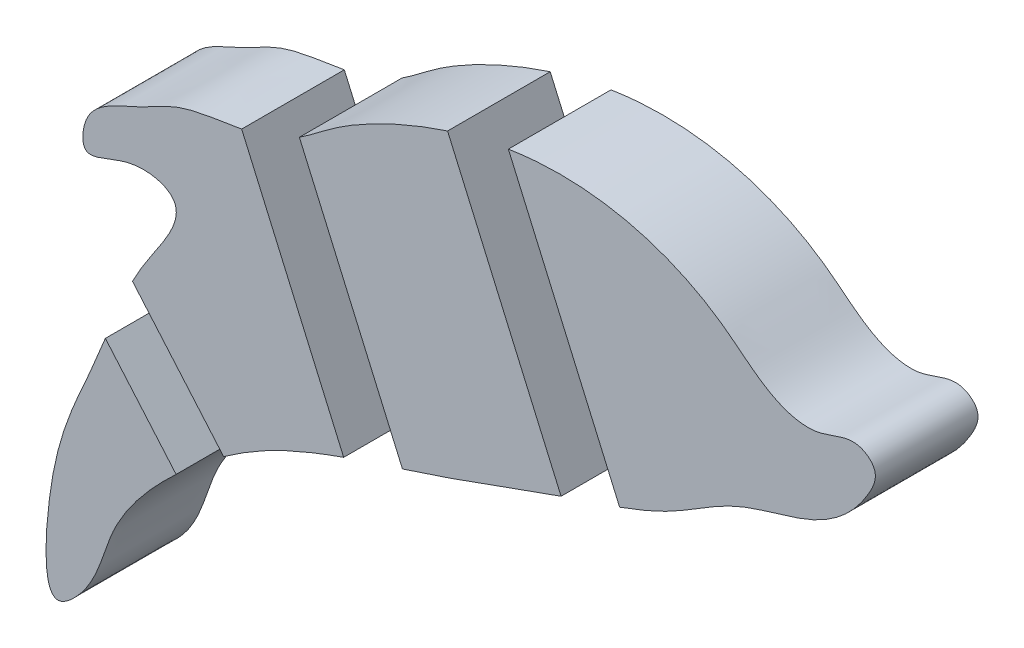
ISO-10303-21;
HEADER;
FILE_DESCRIPTION(('STEP AP214'),'2;1');
FILE_NAME('part.step','',(''),(''),'','','');
FILE_SCHEMA(('AUTOMOTIVE_DESIGN { 1 0 10303 214 1 1 1 1 }'));
ENDSEC;
DATA;
#1=APPLICATION_CONTEXT('core data for automotive mechanical design processes');
#2=APPLICATION_PROTOCOL_DEFINITION('international standard','automotive_design',2000,#1);
#3=PRODUCT_CONTEXT('',#1,'mechanical');
#4=PRODUCT('Part','Part','',(#3));
#5=PRODUCT_RELATED_PRODUCT_CATEGORY('part','',(#4));
#6=PRODUCT_DEFINITION_FORMATION('','',#4);
#7=PRODUCT_DEFINITION_CONTEXT('part definition',#1,'design');
#8=PRODUCT_DEFINITION('design','',#6,#7);
#9=PRODUCT_DEFINITION_SHAPE('','',#8);
#10=(LENGTH_UNIT() NAMED_UNIT(*) SI_UNIT(.MILLI.,.METRE.));
#11=(NAMED_UNIT(*) PLANE_ANGLE_UNIT() SI_UNIT($,.RADIAN.));
#12=(NAMED_UNIT(*) SI_UNIT($,.STERADIAN.) SOLID_ANGLE_UNIT());
#13=UNCERTAINTY_MEASURE_WITH_UNIT(LENGTH_MEASURE(1.E-05),#10,'distance_accuracy_value','');
#14=(GEOMETRIC_REPRESENTATION_CONTEXT(3) GLOBAL_UNCERTAINTY_ASSIGNED_CONTEXT((#13)) GLOBAL_UNIT_ASSIGNED_CONTEXT((#10,
#11,#12)) REPRESENTATION_CONTEXT('',''));
#15=CARTESIAN_POINT('',(0.,0.,0.));
#16=DIRECTION('',(0.,0.,1.));
#17=DIRECTION('',(1.,0.,0.));
#18=AXIS2_PLACEMENT_3D('',#15,#16,#17);
#19=CARTESIAN_POINT('',(37.1203059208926,62.2396272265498,-5.));
#20=CARTESIAN_POINT('',(35.8660979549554,61.6381032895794,-5.));
#21=CARTESIAN_POINT('',(32.30863685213,60.7225927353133,-5.));
#22=CARTESIAN_POINT('',(27.2047300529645,60.3353029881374,-5.));
#23=CARTESIAN_POINT('',(22.39359329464,57.2751362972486,-5.));
#24=CARTESIAN_POINT('',(17.6999358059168,55.9443120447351,-5.));
#25=CARTESIAN_POINT('',(17.4314041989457,50.3712261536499,-5.));
#26=CARTESIAN_POINT('',(22.1255242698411,53.5459282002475,-5.));
#27=CARTESIAN_POINT('',(28.8152586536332,51.946359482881,-5.));
#28=CARTESIAN_POINT('',(23.1875203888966,44.8884076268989,-5.));
#29=CARTESIAN_POINT('',(20.9504485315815,39.7039102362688,-5.));
#30=CARTESIAN_POINT('',(17.4594819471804,30.7189621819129,-5.));
#31=CARTESIAN_POINT('',(14.1286485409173,25.0744795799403,-5.));
#32=CARTESIAN_POINT('',(13.6862287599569,10.3506758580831,-5.));
#33=CARTESIAN_POINT('',(19.0000210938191,15.3545316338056,-5.));
#34=CARTESIAN_POINT('',(20.0722932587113,21.6561097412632,-5.));
#35=CARTESIAN_POINT('',(26.5069997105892,29.0202375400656,-5.));
#36=CARTESIAN_POINT('',(36.7158844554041,36.763379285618,-5.));
#37=CARTESIAN_POINT('',(50.750427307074,40.5000919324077,-5.));
#38=CARTESIAN_POINT('',(63.859053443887,45.672520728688,-5.));
#39=CARTESIAN_POINT('',(74.2681220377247,48.7767213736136,-5.));
#40=CARTESIAN_POINT('',(81.3393233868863,54.0116663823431,-5.));
#41=CARTESIAN_POINT('',(89.0836168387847,55.2702221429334,-5.));
#42=CARTESIAN_POINT('',(93.4566346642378,59.091979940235,-5.));
#43=CARTESIAN_POINT('',(95.278660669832,63.0436417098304,-5.));
#44=CARTESIAN_POINT('',(92.6379427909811,65.1390069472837,-5.));
#45=CARTESIAN_POINT('',(89.3712942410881,62.9217343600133,-5.));
#46=CARTESIAN_POINT('',(84.378691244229,64.0632459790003,-5.));
#47=CARTESIAN_POINT('',(79.79312847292,68.4909604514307,-5.));
#48=CARTESIAN_POINT('',(72.1298778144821,72.2088629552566,-5.));
#49=CARTESIAN_POINT('',(63.3104934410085,73.128814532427,-5.));
#50=CARTESIAN_POINT('',(54.9234616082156,71.6633869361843,-5.));
#51=CARTESIAN_POINT('',(48.0872509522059,69.1247057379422,-5.));
#52=CARTESIAN_POINT('',(42.0706842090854,65.8735932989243,-5.));
#53=CARTESIAN_POINT('',(38.8595370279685,63.0737705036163,-5.));
#54=CARTESIAN_POINT('',(37.1203059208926,62.2396272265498,-5.));
#55=B_SPLINE_CURVE_WITH_KNOTS('',3,(#19,#20,#21,#22,#23,#24,#25,#26,#27,#28,#29,#30,#31,#32,#33,
#34,#35,#36,#37,#38,#39,#40,#41,#42,#43,#44,#45,#46,#47,#48,#49,#50,#51,#52,#53,#54),
.UNSPECIFIED.,.T.,.F.,(4,1,1,1,1,1,1,1,1,1,1,1,1,1,1,1,1,1,1,1,1,1,1,1,1,1,1,1,1,1,1,1,1,4),(0.,
0.0179608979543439,0.0463689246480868,0.0634560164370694,0.0916658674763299,0.100002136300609,
0.118054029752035,0.137946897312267,0.167684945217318,0.196422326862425,0.220416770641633,
0.283698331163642,0.315678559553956,0.327019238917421,0.357634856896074,0.400499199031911,
0.44544644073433,0.521184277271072,0.582377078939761,0.626691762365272,0.658573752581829,
0.693177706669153,0.722667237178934,0.733029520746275,0.740414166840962,0.758218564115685,
0.775563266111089,0.801847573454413,0.838498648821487,0.882370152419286,0.912708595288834,
0.946724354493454,0.975093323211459,1.),.UNSPECIFIED.);
#56=DIRECTION('',(0.,0.,1.));
#57=VECTOR('',#56,1.);
#58=SURFACE_OF_LINEAR_EXTRUSION('',#55,#57);
#59=CARTESIAN_POINT('',(37.1203059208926,62.2396272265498,5.));
#60=CARTESIAN_POINT('',(35.8660979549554,61.6381032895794,5.));
#61=CARTESIAN_POINT('',(32.30863685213,60.7225927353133,5.));
#62=CARTESIAN_POINT('',(27.2047300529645,60.3353029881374,5.));
#63=CARTESIAN_POINT('',(22.39359329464,57.2751362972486,5.));
#64=CARTESIAN_POINT('',(17.6999358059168,55.9443120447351,5.));
#65=CARTESIAN_POINT('',(17.4314041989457,50.3712261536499,5.));
#66=CARTESIAN_POINT('',(22.1255242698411,53.5459282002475,5.));
#67=CARTESIAN_POINT('',(28.8152586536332,51.946359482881,5.));
#68=CARTESIAN_POINT('',(23.1875203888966,44.8884076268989,5.));
#69=CARTESIAN_POINT('',(20.9504485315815,39.7039102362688,5.));
#70=CARTESIAN_POINT('',(17.4594819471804,30.7189621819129,5.));
#71=CARTESIAN_POINT('',(14.1286485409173,25.0744795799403,5.));
#72=CARTESIAN_POINT('',(13.6862287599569,10.3506758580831,5.));
#73=CARTESIAN_POINT('',(19.0000210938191,15.3545316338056,5.));
#74=CARTESIAN_POINT('',(20.0722932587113,21.6561097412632,5.));
#75=CARTESIAN_POINT('',(26.5069997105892,29.0202375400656,5.));
#76=CARTESIAN_POINT('',(36.7158844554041,36.763379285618,5.));
#77=CARTESIAN_POINT('',(50.750427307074,40.5000919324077,5.));
#78=CARTESIAN_POINT('',(63.859053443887,45.672520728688,5.));
#79=CARTESIAN_POINT('',(74.2681220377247,48.7767213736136,5.));
#80=CARTESIAN_POINT('',(81.3393233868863,54.0116663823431,5.));
#81=CARTESIAN_POINT('',(89.0836168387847,55.2702221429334,5.));
#82=CARTESIAN_POINT('',(93.4566346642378,59.091979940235,5.));
#83=CARTESIAN_POINT('',(95.278660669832,63.0436417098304,5.));
#84=CARTESIAN_POINT('',(92.6379427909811,65.1390069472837,5.));
#85=CARTESIAN_POINT('',(89.3712942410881,62.9217343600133,5.));
#86=CARTESIAN_POINT('',(84.378691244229,64.0632459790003,5.));
#87=CARTESIAN_POINT('',(79.79312847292,68.4909604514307,5.));
#88=CARTESIAN_POINT('',(72.1298778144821,72.2088629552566,5.));
#89=CARTESIAN_POINT('',(63.3104934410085,73.128814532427,5.));
#90=CARTESIAN_POINT('',(54.9234616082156,71.6633869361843,5.));
#91=CARTESIAN_POINT('',(48.0872509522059,69.1247057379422,5.));
#92=CARTESIAN_POINT('',(42.0706842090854,65.8735932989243,5.));
#93=CARTESIAN_POINT('',(38.8595370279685,63.0737705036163,5.));
#94=CARTESIAN_POINT('',(37.1203059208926,62.2396272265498,5.));
#95=B_SPLINE_CURVE_WITH_KNOTS('',3,(#59,#60,#61,#62,#63,#64,#65,#66,#67,#68,#69,#70,#71,#72,#73,
#74,#75,#76,#77,#78,#79,#80,#81,#82,#83,#84,#85,#86,#87,#88,#89,#90,#91,#92,#93,#94),
.UNSPECIFIED.,.T.,.F.,(4,1,1,1,1,1,1,1,1,1,1,1,1,1,1,1,1,1,1,1,1,1,1,1,1,1,1,1,1,1,1,1,1,4),(0.,
0.0179608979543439,0.0463689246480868,0.0634560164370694,0.0916658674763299,0.100002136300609,
0.118054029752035,0.137946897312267,0.167684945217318,0.196422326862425,0.220416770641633,
0.283698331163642,0.315678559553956,0.327019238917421,0.357634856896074,0.400499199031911,
0.44544644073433,0.521184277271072,0.582377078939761,0.626691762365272,0.658573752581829,
0.693177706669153,0.722667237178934,0.733029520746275,0.740414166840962,0.758218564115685,
0.775563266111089,0.801847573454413,0.838498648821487,0.882370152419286,0.912708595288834,
0.946724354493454,0.975093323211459,1.),.UNSPECIFIED.);
#96=CARTESIAN_POINT('',(69.8901699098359,47.5297834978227,5.));
#97=VERTEX_POINT('',#96);
#98=CARTESIAN_POINT('',(59.0503238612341,72.3205408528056,5.));
#99=VERTEX_POINT('',#98);
#100=EDGE_CURVE('E55',#97,#99,#95,.T.);
#101=ORIENTED_EDGE('',*,*,#100,.F.);
#102=DIRECTION('',(0.,0.,1.));
#103=VECTOR('',#102,1.);
#104=CARTESIAN_POINT('',(69.8901699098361,47.5297834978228,-5.));
#105=LINE('',#104,#103);
#106=CARTESIAN_POINT('',(69.8901699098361,47.5297834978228,-5.));
#107=VERTEX_POINT('',#106);
#108=EDGE_CURVE('E68',#97,#107,#105,.F.);
#109=ORIENTED_EDGE('',*,*,#108,.T.);
#110=CARTESIAN_POINT('',(59.0503238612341,72.3205408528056,-5.));
#111=VERTEX_POINT('',#110);
#112=EDGE_CURVE('E83',#107,#111,#55,.T.);
#113=ORIENTED_EDGE('',*,*,#112,.T.);
#114=DIRECTION('',(0.,0.,1.));
#115=VECTOR('',#114,1.);
#116=CARTESIAN_POINT('',(59.0503238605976,72.3205408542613,-5.));
#117=LINE('',#116,#115);
#118=EDGE_CURVE('E75',#111,#99,#117,.T.);
#119=ORIENTED_EDGE('',*,*,#118,.T.);
#120=EDGE_LOOP('',(#101,#109,#113,#119));
#121=FACE_BOUND('',#120,.T.);
#122=ADVANCED_FACE('F51',(#121),#58,.T.);
#123=CARTESIAN_POINT('',(46.9083327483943,39.5904772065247,-5.));
#124=DIRECTION('',(0.,0.,-1.));
#125=DIRECTION('',(-1.,0.,0.));
#126=AXIS2_PLACEMENT_3D('',#123,#124,#125);
#127=PLANE('',#126);
#128=ORIENTED_EDGE('',*,*,#112,.F.);
#129=DIRECTION('',(-0.400629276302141,0.916240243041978,0.));
#130=VECTOR('',#129,1.);
#131=CARTESIAN_POINT('',(58.298125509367,74.0408205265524,-5.));
#132=LINE('',#131,#130);
#133=EDGE_CURVE('E78',#107,#111,#132,.T.);
#134=ORIENTED_EDGE('',*,*,#133,.T.);
#135=EDGE_LOOP('',(#128,#134));
#136=FACE_BOUND('',#135,.T.);
#137=ADVANCED_FACE('F87',(#136),#127,.T.);
#138=CARTESIAN_POINT('',(46.9083327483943,39.5904772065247,5.));
#139=DIRECTION('',(0.,0.,-1.));
#140=DIRECTION('',(-1.,0.,0.));
#141=AXIS2_PLACEMENT_3D('',#138,#139,#140);
#142=PLANE('',#141);
#143=DIRECTION('',(-0.400629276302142,0.916240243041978,0.));
#144=VECTOR('',#143,1.);
#145=CARTESIAN_POINT('',(69.115799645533,49.3007703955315,5.));
#146=LINE('',#145,#144);
#147=EDGE_CURVE('E12',#97,#99,#146,.T.);
#148=ORIENTED_EDGE('',*,*,#147,.F.);
#149=ORIENTED_EDGE('',*,*,#100,.T.);
#150=EDGE_LOOP('',(#148,#149));
#151=FACE_BOUND('',#150,.T.);
#152=ADVANCED_FACE('F97',(#151),#142,.F.);
#153=CARTESIAN_POINT('',(58.298125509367,74.0408205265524,5.));
#154=DIRECTION('',(-0.916240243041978,-0.400629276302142,0.));
#155=DIRECTION('',(0.400629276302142,-0.916240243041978,0.));
#156=AXIS2_PLACEMENT_3D('',#153,#154,#155);
#157=PLANE('',#156);
#158=ORIENTED_EDGE('',*,*,#147,.T.);
#159=ORIENTED_EDGE('',*,*,#118,.F.);
#160=ORIENTED_EDGE('',*,*,#133,.F.);
#161=ORIENTED_EDGE('',*,*,#108,.F.);
#162=EDGE_LOOP('',(#158,#159,#160,#161));
#163=FACE_BOUND('',#162,.T.);
#164=ADVANCED_FACE('F77',(#163),#157,.T.);
#165=CLOSED_SHELL('',(#122,#137,#152,#164));
#166=MANIFOLD_SOLID_BREP('B2',#165);
#167=CARTESIAN_POINT('',(46.9083327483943,39.5904772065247,5.));
#168=DIRECTION('',(0.,0.,-1.));
#169=DIRECTION('',(-1.,0.,0.));
#170=AXIS2_PLACEMENT_3D('',#167,#168,#169);
#171=PLANE('',#170);
#172=DIRECTION('',(0.400629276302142,-0.916240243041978,0.));
#173=VECTOR('',#172,1.);
#174=CARTESIAN_POINT('',(43.1566051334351,37.9500210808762,5.));
#175=LINE('',#174,#173);
#176=CARTESIAN_POINT('',(33.0687861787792,61.0208903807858,5.));
#177=VERTEX_POINT('',#176);
#178=CARTESIAN_POINT('',(43.0074433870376,38.2911544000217,5.));
#179=VERTEX_POINT('',#178);
#180=EDGE_CURVE('E49',#177,#179,#175,.T.);
#181=ORIENTED_EDGE('',*,*,#180,.F.);
#182=CARTESIAN_POINT('',(37.1203059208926,62.2396272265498,5.));
#183=CARTESIAN_POINT('',(35.8660979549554,61.6381032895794,5.));
#184=CARTESIAN_POINT('',(32.30863685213,60.7225927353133,5.));
#185=CARTESIAN_POINT('',(27.2047300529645,60.3353029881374,5.));
#186=CARTESIAN_POINT('',(22.39359329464,57.2751362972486,5.));
#187=CARTESIAN_POINT('',(17.6999358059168,55.9443120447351,5.));
#188=CARTESIAN_POINT('',(17.4314041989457,50.3712261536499,5.));
#189=CARTESIAN_POINT('',(22.1255242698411,53.5459282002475,5.));
#190=CARTESIAN_POINT('',(28.8152586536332,51.946359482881,5.));
#191=CARTESIAN_POINT('',(23.1875203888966,44.8884076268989,5.));
#192=CARTESIAN_POINT('',(20.9504485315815,39.7039102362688,5.));
#193=CARTESIAN_POINT('',(17.4594819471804,30.7189621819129,5.));
#194=CARTESIAN_POINT('',(14.1286485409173,25.0744795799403,5.));
#195=CARTESIAN_POINT('',(13.6862287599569,10.3506758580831,5.));
#196=CARTESIAN_POINT('',(19.0000210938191,15.3545316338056,5.));
#197=CARTESIAN_POINT('',(20.0722932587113,21.6561097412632,5.));
#198=CARTESIAN_POINT('',(26.5069997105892,29.0202375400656,5.));
#199=CARTESIAN_POINT('',(36.7158844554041,36.763379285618,5.));
#200=CARTESIAN_POINT('',(50.750427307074,40.5000919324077,5.));
#201=CARTESIAN_POINT('',(63.859053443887,45.672520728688,5.));
#202=CARTESIAN_POINT('',(74.2681220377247,48.7767213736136,5.));
#203=CARTESIAN_POINT('',(81.3393233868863,54.0116663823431,5.));
#204=CARTESIAN_POINT('',(89.0836168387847,55.2702221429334,5.));
#205=CARTESIAN_POINT('',(93.4566346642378,59.091979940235,5.));
#206=CARTESIAN_POINT('',(95.278660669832,63.0436417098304,5.));
#207=CARTESIAN_POINT('',(92.6379427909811,65.1390069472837,5.));
#208=CARTESIAN_POINT('',(89.3712942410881,62.9217343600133,5.));
#209=CARTESIAN_POINT('',(84.378691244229,64.0632459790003,5.));
#210=CARTESIAN_POINT('',(79.79312847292,68.4909604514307,5.));
#211=CARTESIAN_POINT('',(72.1298778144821,72.2088629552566,5.));
#212=CARTESIAN_POINT('',(63.3104934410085,73.128814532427,5.));
#213=CARTESIAN_POINT('',(54.9234616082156,71.6633869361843,5.));
#214=CARTESIAN_POINT('',(48.0872509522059,69.1247057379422,5.));
#215=CARTESIAN_POINT('',(42.0706842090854,65.8735932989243,5.));
#216=CARTESIAN_POINT('',(38.8595370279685,63.0737705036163,5.));
#217=CARTESIAN_POINT('',(37.1203059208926,62.2396272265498,5.));
#218=B_SPLINE_CURVE_WITH_KNOTS('',3,(#182,#183,#184,#185,#186,#187,#188,#189,#190,#191,#192,
#193,#194,#195,#196,#197,#198,#199,#200,#201,#202,#203,#204,#205,#206,#207,#208,#209,#210,#211,
#212,#213,#214,#215,#216,#217),.UNSPECIFIED.,.T.,.F.,(4,1,1,1,1,1,1,1,1,1,1,1,1,1,1,1,1,1,1,1,1,
1,1,1,1,1,1,1,1,1,1,1,1,4),(0.,0.0179608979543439,0.0463689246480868,0.0634560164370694,
0.0916658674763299,0.100002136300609,0.118054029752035,0.137946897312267,0.167684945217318,
0.196422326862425,0.220416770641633,0.283698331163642,0.315678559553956,0.327019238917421,
0.357634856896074,0.400499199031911,0.44544644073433,0.521184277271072,0.582377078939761,
0.626691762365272,0.658573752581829,0.693177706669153,0.722667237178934,0.733029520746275,
0.740414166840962,0.758218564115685,0.775563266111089,0.801847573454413,0.838498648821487,
0.882370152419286,0.912708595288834,0.946724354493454,0.975093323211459,1.),.UNSPECIFIED.);
#219=CARTESIAN_POINT('',(22.4288288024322,42.8628652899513,5.));
#220=VERTEX_POINT('',#219);
#221=EDGE_CURVE('E148',#177,#220,#218,.T.);
#222=ORIENTED_EDGE('',*,*,#221,.T.);
#223=DIRECTION('',(-0.651132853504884,0.758963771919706,0.));
#224=VECTOR('',#223,1.);
#225=CARTESIAN_POINT('',(34.4246710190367,28.8804504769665,5.));
#226=LINE('',#225,#224);
#227=CARTESIAN_POINT('',(31.3137634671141,32.506540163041,5.));
#228=VERTEX_POINT('',#227);
#229=EDGE_CURVE('E155',#228,#220,#226,.T.);
#230=ORIENTED_EDGE('',*,*,#229,.F.);
#231=EDGE_CURVE('E217',#228,#179,#218,.T.);
#232=ORIENTED_EDGE('',*,*,#231,.T.);
#233=EDGE_LOOP('',(#181,#222,#230,#232));
#234=FACE_BOUND('',#233,.T.);
#235=ADVANCED_FACE('F143',(#234),#171,.F.);
#236=CARTESIAN_POINT('',(46.9083327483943,39.5904772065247,-5.));
#237=DIRECTION('',(0.,0.,-1.));
#238=DIRECTION('',(-1.,0.,0.));
#239=AXIS2_PLACEMENT_3D('',#236,#237,#238);
#240=PLANE('',#239);
#241=CARTESIAN_POINT('',(37.1203059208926,62.2396272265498,-5.));
#242=CARTESIAN_POINT('',(35.8660979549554,61.6381032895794,-5.));
#243=CARTESIAN_POINT('',(32.30863685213,60.7225927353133,-5.));
#244=CARTESIAN_POINT('',(27.2047300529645,60.3353029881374,-5.));
#245=CARTESIAN_POINT('',(22.39359329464,57.2751362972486,-5.));
#246=CARTESIAN_POINT('',(17.6999358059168,55.9443120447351,-5.));
#247=CARTESIAN_POINT('',(17.4314041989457,50.3712261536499,-5.));
#248=CARTESIAN_POINT('',(22.1255242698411,53.5459282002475,-5.));
#249=CARTESIAN_POINT('',(28.8152586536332,51.946359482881,-5.));
#250=CARTESIAN_POINT('',(23.1875203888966,44.8884076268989,-5.));
#251=CARTESIAN_POINT('',(20.9504485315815,39.7039102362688,-5.));
#252=CARTESIAN_POINT('',(17.4594819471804,30.7189621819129,-5.));
#253=CARTESIAN_POINT('',(14.1286485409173,25.0744795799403,-5.));
#254=CARTESIAN_POINT('',(13.6862287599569,10.3506758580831,-5.));
#255=CARTESIAN_POINT('',(19.0000210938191,15.3545316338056,-5.));
#256=CARTESIAN_POINT('',(20.0722932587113,21.6561097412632,-5.));
#257=CARTESIAN_POINT('',(26.5069997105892,29.0202375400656,-5.));
#258=CARTESIAN_POINT('',(36.7158844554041,36.763379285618,-5.));
#259=CARTESIAN_POINT('',(50.750427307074,40.5000919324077,-5.));
#260=CARTESIAN_POINT('',(63.859053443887,45.672520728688,-5.));
#261=CARTESIAN_POINT('',(74.2681220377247,48.7767213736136,-5.));
#262=CARTESIAN_POINT('',(81.3393233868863,54.0116663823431,-5.));
#263=CARTESIAN_POINT('',(89.0836168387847,55.2702221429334,-5.));
#264=CARTESIAN_POINT('',(93.4566346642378,59.091979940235,-5.));
#265=CARTESIAN_POINT('',(95.278660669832,63.0436417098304,-5.));
#266=CARTESIAN_POINT('',(92.6379427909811,65.1390069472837,-5.));
#267=CARTESIAN_POINT('',(89.3712942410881,62.9217343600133,-5.));
#268=CARTESIAN_POINT('',(84.378691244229,64.0632459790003,-5.));
#269=CARTESIAN_POINT('',(79.79312847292,68.4909604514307,-5.));
#270=CARTESIAN_POINT('',(72.1298778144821,72.2088629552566,-5.));
#271=CARTESIAN_POINT('',(63.3104934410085,73.128814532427,-5.));
#272=CARTESIAN_POINT('',(54.9234616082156,71.6633869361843,-5.));
#273=CARTESIAN_POINT('',(48.0872509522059,69.1247057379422,-5.));
#274=CARTESIAN_POINT('',(42.0706842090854,65.8735932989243,-5.));
#275=CARTESIAN_POINT('',(38.8595370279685,63.0737705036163,-5.));
#276=CARTESIAN_POINT('',(37.1203059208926,62.2396272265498,-5.));
#277=B_SPLINE_CURVE_WITH_KNOTS('',3,(#241,#242,#243,#244,#245,#246,#247,#248,#249,#250,#251,
#252,#253,#254,#255,#256,#257,#258,#259,#260,#261,#262,#263,#264,#265,#266,#267,#268,#269,#270,
#271,#272,#273,#274,#275,#276),.UNSPECIFIED.,.T.,.F.,(4,1,1,1,1,1,1,1,1,1,1,1,1,1,1,1,1,1,1,1,1,
1,1,1,1,1,1,1,1,1,1,1,1,4),(0.,0.0179608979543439,0.0463689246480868,0.0634560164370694,
0.0916658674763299,0.100002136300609,0.118054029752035,0.137946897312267,0.167684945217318,
0.196422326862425,0.220416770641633,0.283698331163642,0.315678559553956,0.327019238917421,
0.357634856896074,0.400499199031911,0.44544644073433,0.521184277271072,0.582377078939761,
0.626691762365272,0.658573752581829,0.693177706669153,0.722667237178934,0.733029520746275,
0.740414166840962,0.758218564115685,0.775563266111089,0.801847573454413,0.838498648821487,
0.882370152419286,0.912708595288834,0.946724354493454,0.975093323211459,1.),.UNSPECIFIED.);
#278=CARTESIAN_POINT('',(33.0687861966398,61.0208903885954,-5.));
#279=VERTEX_POINT('',#278);
#280=CARTESIAN_POINT('',(22.4288288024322,42.8628652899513,-5.));
#281=VERTEX_POINT('',#280);
#282=EDGE_CURVE('E192',#279,#281,#277,.T.);
#283=ORIENTED_EDGE('',*,*,#282,.F.);
#284=DIRECTION('',(0.400629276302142,-0.916240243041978,0.));
#285=VECTOR('',#284,1.);
#286=CARTESIAN_POINT('',(31.9391517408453,63.6043674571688,-5.));
#287=LINE('',#286,#285);
#288=CARTESIAN_POINT('',(43.0074433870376,38.2911544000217,-5.));
#289=VERTEX_POINT('',#288);
#290=EDGE_CURVE('E201',#279,#289,#287,.T.);
#291=ORIENTED_EDGE('',*,*,#290,.T.);
#292=CARTESIAN_POINT('',(31.3137634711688,32.5065401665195,-5.));
#293=VERTEX_POINT('',#292);
#294=EDGE_CURVE('E200',#293,#289,#277,.T.);
#295=ORIENTED_EDGE('',*,*,#294,.F.);
#296=DIRECTION('',(-0.651132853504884,0.758963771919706,0.));
#297=VECTOR('',#296,1.);
#298=CARTESIAN_POINT('',(21.2157988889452,44.2767791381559,-5.));
#299=LINE('',#298,#297);
#300=EDGE_CURVE('E185',#293,#281,#299,.T.);
#301=ORIENTED_EDGE('',*,*,#300,.T.);
#302=EDGE_LOOP('',(#283,#291,#295,#301));
#303=FACE_BOUND('',#302,.T.);
#304=ADVANCED_FACE('F197',(#303),#240,.T.);
#305=DIRECTION('',(0.,0.,1.));
#306=VECTOR('',#305,1.);
#307=SURFACE_OF_LINEAR_EXTRUSION('',#277,#306);
#308=ORIENTED_EDGE('',*,*,#294,.T.);
#309=DIRECTION('',(0.,0.,1.));
#310=VECTOR('',#309,1.);
#311=CARTESIAN_POINT('',(43.0074433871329,38.2911543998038,-5.));
#312=LINE('',#311,#310);
#313=EDGE_CURVE('E209',#289,#179,#312,.T.);
#314=ORIENTED_EDGE('',*,*,#313,.T.);
#315=ORIENTED_EDGE('',*,*,#231,.F.);
#316=DIRECTION('',(0.,0.,1.));
#317=VECTOR('',#316,1.);
#318=CARTESIAN_POINT('',(31.3137634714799,32.5065401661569,-5.));
#319=LINE('',#318,#317);
#320=EDGE_CURVE('E203',#228,#293,#319,.F.);
#321=ORIENTED_EDGE('',*,*,#320,.T.);
#322=EDGE_LOOP('',(#308,#314,#315,#321));
#323=FACE_BOUND('',#322,.T.);
#324=ADVANCED_FACE('F231',(#323),#307,.T.);
#325=ORIENTED_EDGE('',*,*,#221,.F.);
#326=DIRECTION('',(0.,0.,1.));
#327=VECTOR('',#326,1.);
#328=CARTESIAN_POINT('',(33.0687861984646,61.0208903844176,-5.));
#329=LINE('',#328,#327);
#330=EDGE_CURVE('E163',#177,#279,#329,.F.);
#331=ORIENTED_EDGE('',*,*,#330,.T.);
#332=ORIENTED_EDGE('',*,*,#282,.T.);
#333=DIRECTION('',(0.,0.,1.));
#334=VECTOR('',#333,1.);
#335=CARTESIAN_POINT('',(22.4288288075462,42.8628652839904,-5.));
#336=LINE('',#335,#334);
#337=EDGE_CURVE('E181',#281,#220,#336,.T.);
#338=ORIENTED_EDGE('',*,*,#337,.T.);
#339=EDGE_LOOP('',(#325,#331,#332,#338));
#340=FACE_BOUND('',#339,.T.);
#341=ADVANCED_FACE('F145',(#340),#307,.T.);
#342=CARTESIAN_POINT('',(21.2157988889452,44.2767791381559,5.));
#343=DIRECTION('',(-0.758963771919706,-0.651132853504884,0.));
#344=DIRECTION('',(0.651132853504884,-0.758963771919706,0.));
#345=AXIS2_PLACEMENT_3D('',#342,#343,#344);
#346=PLANE('',#345);
#347=ORIENTED_EDGE('',*,*,#300,.F.);
#348=ORIENTED_EDGE('',*,*,#320,.F.);
#349=ORIENTED_EDGE('',*,*,#229,.T.);
#350=ORIENTED_EDGE('',*,*,#337,.F.);
#351=EDGE_LOOP('',(#347,#348,#349,#350));
#352=FACE_BOUND('',#351,.T.);
#353=ADVANCED_FACE('F183',(#352),#346,.T.);
#354=CARTESIAN_POINT('',(31.9391517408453,63.6043674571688,5.));
#355=DIRECTION('',(0.916240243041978,0.400629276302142,0.));
#356=DIRECTION('',(-0.400629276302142,0.916240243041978,0.));
#357=AXIS2_PLACEMENT_3D('',#354,#355,#356);
#358=PLANE('',#357);
#359=ORIENTED_EDGE('',*,*,#180,.T.);
#360=ORIENTED_EDGE('',*,*,#313,.F.);
#361=ORIENTED_EDGE('',*,*,#290,.F.);
#362=ORIENTED_EDGE('',*,*,#330,.F.);
#363=EDGE_LOOP('',(#359,#360,#361,#362));
#364=FACE_BOUND('',#363,.T.);
#365=ADVANCED_FACE('F219',(#364),#358,.T.);
#366=CLOSED_SHELL('',(#235,#304,#324,#341,#353,#365));
#367=MANIFOLD_SOLID_BREP('B6',#366);
#368=CARTESIAN_POINT('',(46.9083327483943,39.5904772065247,-5.));
#369=DIRECTION('',(0.,0.,-1.));
#370=DIRECTION('',(-1.,0.,0.));
#371=AXIS2_PLACEMENT_3D('',#368,#369,#370);
#372=PLANE('',#371);
#373=CARTESIAN_POINT('',(37.1203059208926,62.2396272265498,-5.));
#374=CARTESIAN_POINT('',(35.8660979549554,61.6381032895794,-5.));
#375=CARTESIAN_POINT('',(32.30863685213,60.7225927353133,-5.));
#376=CARTESIAN_POINT('',(27.2047300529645,60.3353029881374,-5.));
#377=CARTESIAN_POINT('',(22.39359329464,57.2751362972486,-5.));
#378=CARTESIAN_POINT('',(17.6999358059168,55.9443120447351,-5.));
#379=CARTESIAN_POINT('',(17.4314041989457,50.3712261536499,-5.));
#380=CARTESIAN_POINT('',(22.1255242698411,53.5459282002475,-5.));
#381=CARTESIAN_POINT('',(28.8152586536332,51.946359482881,-5.));
#382=CARTESIAN_POINT('',(23.1875203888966,44.8884076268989,-5.));
#383=CARTESIAN_POINT('',(20.9504485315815,39.7039102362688,-5.));
#384=CARTESIAN_POINT('',(17.4594819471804,30.7189621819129,-5.));
#385=CARTESIAN_POINT('',(14.1286485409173,25.0744795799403,-5.));
#386=CARTESIAN_POINT('',(13.6862287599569,10.3506758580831,-5.));
#387=CARTESIAN_POINT('',(19.0000210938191,15.3545316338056,-5.));
#388=CARTESIAN_POINT('',(20.0722932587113,21.6561097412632,-5.));
#389=CARTESIAN_POINT('',(26.5069997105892,29.0202375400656,-5.));
#390=CARTESIAN_POINT('',(36.7158844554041,36.763379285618,-5.));
#391=CARTESIAN_POINT('',(50.750427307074,40.5000919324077,-5.));
#392=CARTESIAN_POINT('',(63.859053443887,45.672520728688,-5.));
#393=CARTESIAN_POINT('',(74.2681220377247,48.7767213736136,-5.));
#394=CARTESIAN_POINT('',(81.3393233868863,54.0116663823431,-5.));
#395=CARTESIAN_POINT('',(89.0836168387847,55.2702221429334,-5.));
#396=CARTESIAN_POINT('',(93.4566346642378,59.091979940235,-5.));
#397=CARTESIAN_POINT('',(95.278660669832,63.0436417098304,-5.));
#398=CARTESIAN_POINT('',(92.6379427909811,65.1390069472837,-5.));
#399=CARTESIAN_POINT('',(89.3712942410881,62.9217343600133,-5.));
#400=CARTESIAN_POINT('',(84.378691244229,64.0632459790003,-5.));
#401=CARTESIAN_POINT('',(79.79312847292,68.4909604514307,-5.));
#402=CARTESIAN_POINT('',(72.1298778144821,72.2088629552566,-5.));
#403=CARTESIAN_POINT('',(63.3104934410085,73.128814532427,-5.));
#404=CARTESIAN_POINT('',(54.9234616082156,71.6633869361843,-5.));
#405=CARTESIAN_POINT('',(48.0872509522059,69.1247057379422,-5.));
#406=CARTESIAN_POINT('',(42.0706842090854,65.8735932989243,-5.));
#407=CARTESIAN_POINT('',(38.8595370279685,63.0737705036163,-5.));
#408=CARTESIAN_POINT('',(37.1203059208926,62.2396272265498,-5.));
#409=B_SPLINE_CURVE_WITH_KNOTS('',3,(#373,#374,#375,#376,#377,#378,#379,#380,#381,#382,#383,
#384,#385,#386,#387,#388,#389,#390,#391,#392,#393,#394,#395,#396,#397,#398,#399,#400,#401,#402,
#403,#404,#405,#406,#407,#408),.UNSPECIFIED.,.T.,.F.,(4,1,1,1,1,1,1,1,1,1,1,1,1,1,1,1,1,1,1,1,1,
1,1,1,1,1,1,1,1,1,1,1,1,4),(0.,0.0179608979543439,0.0463689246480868,0.0634560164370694,
0.0916658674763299,0.100002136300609,0.118054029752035,0.137946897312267,0.167684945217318,
0.196422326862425,0.220416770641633,0.283698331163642,0.315678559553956,0.327019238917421,
0.357634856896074,0.400499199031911,0.44544644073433,0.521184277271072,0.582377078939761,
0.626691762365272,0.658573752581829,0.693177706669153,0.722667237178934,0.733029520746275,
0.740414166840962,0.758218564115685,0.775563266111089,0.801847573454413,0.838498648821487,
0.882370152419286,0.912708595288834,0.946724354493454,0.975093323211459,1.),.UNSPECIFIED.);
#410=CARTESIAN_POINT('',(19.7904320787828,36.7234845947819,-5.));
#411=VERTEX_POINT('',#410);
#412=CARTESIAN_POINT('',(26.6813304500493,28.6914183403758,-5.));
#413=VERTEX_POINT('',#412);
#414=EDGE_CURVE('E316',#411,#413,#409,.T.);
#415=ORIENTED_EDGE('',*,*,#414,.F.);
#416=DIRECTION('',(0.651132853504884,-0.758963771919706,0.));
#417=VECTOR('',#416,1.);
#418=CARTESIAN_POINT('',(16.6620162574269,40.3699820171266,-5.));
#419=LINE('',#418,#417);
#420=EDGE_CURVE('E311',#411,#413,#419,.T.);
#421=ORIENTED_EDGE('',*,*,#420,.T.);
#422=EDGE_LOOP('',(#415,#421));
#423=FACE_BOUND('',#422,.T.);
#424=ADVANCED_FACE('F283',(#423),#372,.T.);
#425=CARTESIAN_POINT('',(46.9083327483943,39.5904772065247,5.));
#426=DIRECTION('',(0.,0.,-1.));
#427=DIRECTION('',(-1.,0.,0.));
#428=AXIS2_PLACEMENT_3D('',#425,#426,#427);
#429=PLANE('',#428);
#430=DIRECTION('',(0.651132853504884,-0.758963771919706,0.));
#431=VECTOR('',#430,1.);
#432=CARTESIAN_POINT('',(29.8708883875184,24.9736533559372,5.));
#433=LINE('',#432,#431);
#434=CARTESIAN_POINT('',(19.7904320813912,36.7234845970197,5.));
#435=VERTEX_POINT('',#434);
#436=CARTESIAN_POINT('',(26.6813304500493,28.6914183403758,5.));
#437=VERTEX_POINT('',#436);
#438=EDGE_CURVE('E141',#435,#437,#433,.T.);
#439=ORIENTED_EDGE('',*,*,#438,.F.);
#440=CARTESIAN_POINT('',(37.1203059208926,62.2396272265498,5.));
#441=CARTESIAN_POINT('',(35.8660979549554,61.6381032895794,5.));
#442=CARTESIAN_POINT('',(32.30863685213,60.7225927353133,5.));
#443=CARTESIAN_POINT('',(27.2047300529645,60.3353029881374,5.));
#444=CARTESIAN_POINT('',(22.39359329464,57.2751362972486,5.));
#445=CARTESIAN_POINT('',(17.6999358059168,55.9443120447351,5.));
#446=CARTESIAN_POINT('',(17.4314041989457,50.3712261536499,5.));
#447=CARTESIAN_POINT('',(22.1255242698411,53.5459282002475,5.));
#448=CARTESIAN_POINT('',(28.8152586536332,51.946359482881,5.));
#449=CARTESIAN_POINT('',(23.1875203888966,44.8884076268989,5.));
#450=CARTESIAN_POINT('',(20.9504485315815,39.7039102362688,5.));
#451=CARTESIAN_POINT('',(17.4594819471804,30.7189621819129,5.));
#452=CARTESIAN_POINT('',(14.1286485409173,25.0744795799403,5.));
#453=CARTESIAN_POINT('',(13.6862287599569,10.3506758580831,5.));
#454=CARTESIAN_POINT('',(19.0000210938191,15.3545316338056,5.));
#455=CARTESIAN_POINT('',(20.0722932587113,21.6561097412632,5.));
#456=CARTESIAN_POINT('',(26.5069997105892,29.0202375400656,5.));
#457=CARTESIAN_POINT('',(36.7158844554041,36.763379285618,5.));
#458=CARTESIAN_POINT('',(50.750427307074,40.5000919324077,5.));
#459=CARTESIAN_POINT('',(63.859053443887,45.672520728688,5.));
#460=CARTESIAN_POINT('',(74.2681220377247,48.7767213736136,5.));
#461=CARTESIAN_POINT('',(81.3393233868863,54.0116663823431,5.));
#462=CARTESIAN_POINT('',(89.0836168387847,55.2702221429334,5.));
#463=CARTESIAN_POINT('',(93.4566346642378,59.091979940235,5.));
#464=CARTESIAN_POINT('',(95.278660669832,63.0436417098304,5.));
#465=CARTESIAN_POINT('',(92.6379427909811,65.1390069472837,5.));
#466=CARTESIAN_POINT('',(89.3712942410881,62.9217343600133,5.));
#467=CARTESIAN_POINT('',(84.378691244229,64.0632459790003,5.));
#468=CARTESIAN_POINT('',(79.79312847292,68.4909604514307,5.));
#469=CARTESIAN_POINT('',(72.1298778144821,72.2088629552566,5.));
#470=CARTESIAN_POINT('',(63.3104934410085,73.128814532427,5.));
#471=CARTESIAN_POINT('',(54.9234616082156,71.6633869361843,5.));
#472=CARTESIAN_POINT('',(48.0872509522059,69.1247057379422,5.));
#473=CARTESIAN_POINT('',(42.0706842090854,65.8735932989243,5.));
#474=CARTESIAN_POINT('',(38.8595370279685,63.0737705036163,5.));
#475=CARTESIAN_POINT('',(37.1203059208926,62.2396272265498,5.));
#476=B_SPLINE_CURVE_WITH_KNOTS('',3,(#440,#441,#442,#443,#444,#445,#446,#447,#448,#449,#450,
#451,#452,#453,#454,#455,#456,#457,#458,#459,#460,#461,#462,#463,#464,#465,#466,#467,#468,#469,
#470,#471,#472,#473,#474,#475),.UNSPECIFIED.,.T.,.F.,(4,1,1,1,1,1,1,1,1,1,1,1,1,1,1,1,1,1,1,1,1,
1,1,1,1,1,1,1,1,1,1,1,1,4),(0.,0.0179608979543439,0.0463689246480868,0.0634560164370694,
0.0916658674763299,0.100002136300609,0.118054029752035,0.137946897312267,0.167684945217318,
0.196422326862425,0.220416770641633,0.283698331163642,0.315678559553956,0.327019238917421,
0.357634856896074,0.400499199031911,0.44544644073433,0.521184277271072,0.582377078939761,
0.626691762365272,0.658573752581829,0.693177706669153,0.722667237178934,0.733029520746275,
0.740414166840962,0.758218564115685,0.775563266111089,0.801847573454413,0.838498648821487,
0.882370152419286,0.912708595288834,0.946724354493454,0.975093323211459,1.),.UNSPECIFIED.);
#477=EDGE_CURVE('E288',#435,#437,#476,.T.);
#478=ORIENTED_EDGE('',*,*,#477,.T.);
#479=EDGE_LOOP('',(#439,#478));
#480=FACE_BOUND('',#479,.T.);
#481=ADVANCED_FACE('F329',(#480),#429,.F.);
#482=DIRECTION('',(0.,0.,1.));
#483=VECTOR('',#482,1.);
#484=SURFACE_OF_LINEAR_EXTRUSION('',#409,#483);
#485=ORIENTED_EDGE('',*,*,#477,.F.);
#486=DIRECTION('',(0.,0.,1.));
#487=VECTOR('',#486,1.);
#488=CARTESIAN_POINT('',(19.7904320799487,36.7234845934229,-5.));
#489=LINE('',#488,#487);
#490=EDGE_CURVE('E302',#435,#411,#489,.F.);
#491=ORIENTED_EDGE('',*,*,#490,.T.);
#492=ORIENTED_EDGE('',*,*,#414,.T.);
#493=DIRECTION('',(0.,0.,1.));
#494=VECTOR('',#493,1.);
#495=CARTESIAN_POINT('',(26.6813304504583,28.6914183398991,-5.));
#496=LINE('',#495,#494);
#497=EDGE_CURVE('E295',#413,#437,#496,.T.);
#498=ORIENTED_EDGE('',*,*,#497,.T.);
#499=EDGE_LOOP('',(#485,#491,#492,#498));
#500=FACE_BOUND('',#499,.T.);
#501=ADVANCED_FACE('F285',(#500),#484,.T.);
#502=CARTESIAN_POINT('',(16.6620162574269,40.3699820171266,5.));
#503=DIRECTION('',(0.758963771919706,0.651132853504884,0.));
#504=DIRECTION('',(-0.651132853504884,0.758963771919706,0.));
#505=AXIS2_PLACEMENT_3D('',#502,#503,#504);
#506=PLANE('',#505);
#507=ORIENTED_EDGE('',*,*,#438,.T.);
#508=ORIENTED_EDGE('',*,*,#497,.F.);
#509=ORIENTED_EDGE('',*,*,#420,.F.);
#510=ORIENTED_EDGE('',*,*,#490,.F.);
#511=EDGE_LOOP('',(#507,#508,#509,#510));
#512=FACE_BOUND('',#511,.T.);
#513=ADVANCED_FACE('F310',(#512),#506,.T.);
#514=CLOSED_SHELL('',(#424,#481,#501,#513));
#515=MANIFOLD_SOLID_BREP('B43',#514);
#516=CARTESIAN_POINT('',(46.9083327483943,39.5904772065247,-5.));
#517=DIRECTION('',(0.,0.,-1.));
#518=DIRECTION('',(-1.,0.,0.));
#519=AXIS2_PLACEMENT_3D('',#516,#517,#518);
#520=PLANE('',#519);
#521=CARTESIAN_POINT('',(37.1203059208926,62.2396272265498,-5.));
#522=CARTESIAN_POINT('',(35.8660979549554,61.6381032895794,-5.));
#523=CARTESIAN_POINT('',(32.30863685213,60.7225927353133,-5.));
#524=CARTESIAN_POINT('',(27.2047300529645,60.3353029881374,-5.));
#525=CARTESIAN_POINT('',(22.39359329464,57.2751362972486,-5.));
#526=CARTESIAN_POINT('',(17.6999358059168,55.9443120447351,-5.));
#527=CARTESIAN_POINT('',(17.4314041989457,50.3712261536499,-5.));
#528=CARTESIAN_POINT('',(22.1255242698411,53.5459282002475,-5.));
#529=CARTESIAN_POINT('',(28.8152586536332,51.946359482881,-5.));
#530=CARTESIAN_POINT('',(23.1875203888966,44.8884076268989,-5.));
#531=CARTESIAN_POINT('',(20.9504485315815,39.7039102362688,-5.));
#532=CARTESIAN_POINT('',(17.4594819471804,30.7189621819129,-5.));
#533=CARTESIAN_POINT('',(14.1286485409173,25.0744795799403,-5.));
#534=CARTESIAN_POINT('',(13.6862287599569,10.3506758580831,-5.));
#535=CARTESIAN_POINT('',(19.0000210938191,15.3545316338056,-5.));
#536=CARTESIAN_POINT('',(20.0722932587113,21.6561097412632,-5.));
#537=CARTESIAN_POINT('',(26.5069997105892,29.0202375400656,-5.));
#538=CARTESIAN_POINT('',(36.7158844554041,36.763379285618,-5.));
#539=CARTESIAN_POINT('',(50.750427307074,40.5000919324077,-5.));
#540=CARTESIAN_POINT('',(63.859053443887,45.672520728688,-5.));
#541=CARTESIAN_POINT('',(74.2681220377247,48.7767213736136,-5.));
#542=CARTESIAN_POINT('',(81.3393233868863,54.0116663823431,-5.));
#543=CARTESIAN_POINT('',(89.0836168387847,55.2702221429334,-5.));
#544=CARTESIAN_POINT('',(93.4566346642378,59.091979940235,-5.));
#545=CARTESIAN_POINT('',(95.278660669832,63.0436417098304,-5.));
#546=CARTESIAN_POINT('',(92.6379427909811,65.1390069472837,-5.));
#547=CARTESIAN_POINT('',(89.3712942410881,62.9217343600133,-5.));
#548=CARTESIAN_POINT('',(84.378691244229,64.0632459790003,-5.));
#549=CARTESIAN_POINT('',(79.79312847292,68.4909604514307,-5.));
#550=CARTESIAN_POINT('',(72.1298778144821,72.2088629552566,-5.));
#551=CARTESIAN_POINT('',(63.3104934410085,73.128814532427,-5.));
#552=CARTESIAN_POINT('',(54.9234616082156,71.6633869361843,-5.));
#553=CARTESIAN_POINT('',(48.0872509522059,69.1247057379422,-5.));
#554=CARTESIAN_POINT('',(42.0706842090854,65.8735932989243,-5.));
#555=CARTESIAN_POINT('',(38.8595370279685,63.0737705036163,-5.));
#556=CARTESIAN_POINT('',(37.1203059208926,62.2396272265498,-5.));
#557=B_SPLINE_CURVE_WITH_KNOTS('',3,(#521,#522,#523,#524,#525,#526,#527,#528,#529,#530,#531,
#532,#533,#534,#535,#536,#537,#538,#539,#540,#541,#542,#543,#544,#545,#546,#547,#548,#549,#550,
#551,#552,#553,#554,#555,#556),.UNSPECIFIED.,.T.,.F.,(4,1,1,1,1,1,1,1,1,1,1,1,1,1,1,1,1,1,1,1,1,
1,1,1,1,1,1,1,1,1,1,1,1,4),(0.,0.0179608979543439,0.0463689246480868,0.0634560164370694,
0.0916658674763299,0.100002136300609,0.118054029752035,0.137946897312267,0.167684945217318,
0.196422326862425,0.220416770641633,0.283698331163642,0.315678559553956,0.327019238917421,
0.357634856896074,0.400499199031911,0.44544644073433,0.521184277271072,0.582377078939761,
0.626691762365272,0.658573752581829,0.693177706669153,0.722667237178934,0.733029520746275,
0.740414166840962,0.758218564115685,0.775563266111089,0.801847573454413,0.838498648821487,
0.882370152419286,0.912708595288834,0.946724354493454,0.975093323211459,1.),.UNSPECIFIED.);
#558=CARTESIAN_POINT('',(53.1278016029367,70.888926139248,-5.));
#559=VERTEX_POINT('',#558);
#560=CARTESIAN_POINT('',(38.6905918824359,63.1402447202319,-5.));
#561=VERTEX_POINT('',#560);
#562=EDGE_CURVE('E423',#559,#561,#557,.T.);
#563=ORIENTED_EDGE('',*,*,#562,.F.);
#564=DIRECTION('',(0.400629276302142,-0.916240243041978,0.));
#565=VECTOR('',#564,1.);
#566=CARTESIAN_POINT('',(52.8006840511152,71.6370448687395,-5.));
#567=LINE('',#566,#565);
#568=CARTESIAN_POINT('',(64.1869485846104,45.5966269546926,-5.));
#569=VERTEX_POINT('',#568);
#570=EDGE_CURVE('E412',#559,#569,#567,.T.);
#571=ORIENTED_EDGE('',*,*,#570,.T.);
#572=CARTESIAN_POINT('',(48.7321107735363,40.1752637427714,-5.));
#573=VERTEX_POINT('',#572);
#574=EDGE_CURVE('E418',#573,#569,#557,.T.);
#575=ORIENTED_EDGE('',*,*,#574,.F.);
#576=DIRECTION('',(-0.400629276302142,0.916240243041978,0.));
#577=VECTOR('',#576,1.);
#578=CARTESIAN_POINT('',(37.4365931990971,66.0081431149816,-5.));
#579=LINE('',#578,#577);
#580=EDGE_CURVE('E404',#573,#561,#579,.T.);
#581=ORIENTED_EDGE('',*,*,#580,.T.);
#582=EDGE_LOOP('',(#563,#571,#575,#581));
#583=FACE_BOUND('',#582,.T.);
#584=ADVANCED_FACE('F365',(#583),#520,.T.);
#585=CARTESIAN_POINT('',(46.9083327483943,39.5904772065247,5.));
#586=DIRECTION('',(0.,0.,-1.));
#587=DIRECTION('',(-1.,0.,0.));
#588=AXIS2_PLACEMENT_3D('',#585,#586,#587);
#589=PLANE('',#588);
#590=DIRECTION('',(0.400629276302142,-0.916240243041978,0.));
#591=VECTOR('',#590,1.);
#592=CARTESIAN_POINT('',(63.6183581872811,46.8969947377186,5.));
#593=LINE('',#592,#591);
#594=CARTESIAN_POINT('',(53.1278016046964,70.8889261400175,5.));
#595=VERTEX_POINT('',#594);
#596=CARTESIAN_POINT('',(64.1869485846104,45.5966269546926,5.));
#597=VERTEX_POINT('',#596);
#598=EDGE_CURVE('E281',#595,#597,#593,.T.);
#599=ORIENTED_EDGE('',*,*,#598,.F.);
#600=CARTESIAN_POINT('',(37.1203059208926,62.2396272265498,5.));
#601=CARTESIAN_POINT('',(35.8660979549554,61.6381032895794,5.));
#602=CARTESIAN_POINT('',(32.30863685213,60.7225927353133,5.));
#603=CARTESIAN_POINT('',(27.2047300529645,60.3353029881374,5.));
#604=CARTESIAN_POINT('',(22.39359329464,57.2751362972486,5.));
#605=CARTESIAN_POINT('',(17.6999358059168,55.9443120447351,5.));
#606=CARTESIAN_POINT('',(17.4314041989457,50.3712261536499,5.));
#607=CARTESIAN_POINT('',(22.1255242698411,53.5459282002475,5.));
#608=CARTESIAN_POINT('',(28.8152586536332,51.946359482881,5.));
#609=CARTESIAN_POINT('',(23.1875203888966,44.8884076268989,5.));
#610=CARTESIAN_POINT('',(20.9504485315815,39.7039102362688,5.));
#611=CARTESIAN_POINT('',(17.4594819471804,30.7189621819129,5.));
#612=CARTESIAN_POINT('',(14.1286485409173,25.0744795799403,5.));
#613=CARTESIAN_POINT('',(13.6862287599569,10.3506758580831,5.));
#614=CARTESIAN_POINT('',(19.0000210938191,15.3545316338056,5.));
#615=CARTESIAN_POINT('',(20.0722932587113,21.6561097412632,5.));
#616=CARTESIAN_POINT('',(26.5069997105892,29.0202375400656,5.));
#617=CARTESIAN_POINT('',(36.7158844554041,36.763379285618,5.));
#618=CARTESIAN_POINT('',(50.750427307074,40.5000919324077,5.));
#619=CARTESIAN_POINT('',(63.859053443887,45.672520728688,5.));
#620=CARTESIAN_POINT('',(74.2681220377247,48.7767213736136,5.));
#621=CARTESIAN_POINT('',(81.3393233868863,54.0116663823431,5.));
#622=CARTESIAN_POINT('',(89.0836168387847,55.2702221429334,5.));
#623=CARTESIAN_POINT('',(93.4566346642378,59.091979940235,5.));
#624=CARTESIAN_POINT('',(95.278660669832,63.0436417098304,5.));
#625=CARTESIAN_POINT('',(92.6379427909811,65.1390069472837,5.));
#626=CARTESIAN_POINT('',(89.3712942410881,62.9217343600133,5.));
#627=CARTESIAN_POINT('',(84.378691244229,64.0632459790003,5.));
#628=CARTESIAN_POINT('',(79.79312847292,68.4909604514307,5.));
#629=CARTESIAN_POINT('',(72.1298778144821,72.2088629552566,5.));
#630=CARTESIAN_POINT('',(63.3104934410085,73.128814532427,5.));
#631=CARTESIAN_POINT('',(54.9234616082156,71.6633869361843,5.));
#632=CARTESIAN_POINT('',(48.0872509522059,69.1247057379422,5.));
#633=CARTESIAN_POINT('',(42.0706842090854,65.8735932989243,5.));
#634=CARTESIAN_POINT('',(38.8595370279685,63.0737705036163,5.));
#635=CARTESIAN_POINT('',(37.1203059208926,62.2396272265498,5.));
#636=B_SPLINE_CURVE_WITH_KNOTS('',3,(#600,#601,#602,#603,#604,#605,#606,#607,#608,#609,#610,
#611,#612,#613,#614,#615,#616,#617,#618,#619,#620,#621,#622,#623,#624,#625,#626,#627,#628,#629,
#630,#631,#632,#633,#634,#635),.UNSPECIFIED.,.T.,.F.,(4,1,1,1,1,1,1,1,1,1,1,1,1,1,1,1,1,1,1,1,1,
1,1,1,1,1,1,1,1,1,1,1,1,4),(0.,0.0179608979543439,0.0463689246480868,0.0634560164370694,
0.0916658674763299,0.100002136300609,0.118054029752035,0.137946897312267,0.167684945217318,
0.196422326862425,0.220416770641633,0.283698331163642,0.315678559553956,0.327019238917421,
0.357634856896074,0.400499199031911,0.44544644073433,0.521184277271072,0.582377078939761,
0.626691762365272,0.658573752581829,0.693177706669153,0.722667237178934,0.733029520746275,
0.740414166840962,0.758218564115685,0.775563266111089,0.801847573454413,0.838498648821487,
0.882370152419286,0.912708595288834,0.946724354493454,0.975093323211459,1.),.UNSPECIFIED.);
#637=CARTESIAN_POINT('',(38.6905918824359,63.1402447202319,5.));
#638=VERTEX_POINT('',#637);
#639=EDGE_CURVE('E428',#595,#638,#636,.T.);
#640=ORIENTED_EDGE('',*,*,#639,.T.);
#641=DIRECTION('',(-0.400629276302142,0.916240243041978,0.));
#642=VECTOR('',#641,1.);
#643=CARTESIAN_POINT('',(48.654046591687,40.3537967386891,5.));
#644=LINE('',#643,#642);
#645=CARTESIAN_POINT('',(48.7321107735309,40.1752637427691,5.));
#646=VERTEX_POINT('',#645);
#647=EDGE_CURVE('E374',#646,#638,#644,.T.);
#648=ORIENTED_EDGE('',*,*,#647,.F.);
#649=EDGE_CURVE('E420',#646,#597,#636,.T.);
#650=ORIENTED_EDGE('',*,*,#649,.T.);
#651=EDGE_LOOP('',(#599,#640,#648,#650));
#652=FACE_BOUND('',#651,.T.);
#653=ADVANCED_FACE('F447',(#652),#589,.F.);
#654=DIRECTION('',(0.,0.,1.));
#655=VECTOR('',#654,1.);
#656=SURFACE_OF_LINEAR_EXTRUSION('',#557,#655);
#657=ORIENTED_EDGE('',*,*,#639,.F.);
#658=DIRECTION('',(0.,0.,1.));
#659=VECTOR('',#658,1.);
#660=CARTESIAN_POINT('',(53.1278016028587,70.8889261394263,-5.));
#661=LINE('',#660,#659);
#662=EDGE_CURVE('E380',#595,#559,#661,.F.);
#663=ORIENTED_EDGE('',*,*,#662,.T.);
#664=ORIENTED_EDGE('',*,*,#562,.T.);
#665=DIRECTION('',(0.,0.,1.));
#666=VECTOR('',#665,1.);
#667=CARTESIAN_POINT('',(38.6905918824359,63.140244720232,-5.));
#668=LINE('',#667,#666);
#669=EDGE_CURVE('E407',#561,#638,#668,.T.);
#670=ORIENTED_EDGE('',*,*,#669,.T.);
#671=EDGE_LOOP('',(#657,#663,#664,#670));
#672=FACE_BOUND('',#671,.T.);
#673=ADVANCED_FACE('F445',(#672),#656,.T.);
#674=ORIENTED_EDGE('',*,*,#574,.T.);
#675=DIRECTION('',(0.,0.,1.));
#676=VECTOR('',#675,1.);
#677=CARTESIAN_POINT('',(64.1869485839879,45.5966269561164,-5.));
#678=LINE('',#677,#676);
#679=EDGE_CURVE('E436',#569,#597,#678,.T.);
#680=ORIENTED_EDGE('',*,*,#679,.T.);
#681=ORIENTED_EDGE('',*,*,#649,.F.);
#682=DIRECTION('',(0.,0.,1.));
#683=VECTOR('',#682,1.);
#684=CARTESIAN_POINT('',(48.7321107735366,40.1752637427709,-5.));
#685=LINE('',#684,#683);
#686=EDGE_CURVE('E388',#646,#573,#685,.F.);
#687=ORIENTED_EDGE('',*,*,#686,.T.);
#688=EDGE_LOOP('',(#674,#680,#681,#687));
#689=FACE_BOUND('',#688,.T.);
#690=ADVANCED_FACE('F367',(#689),#656,.T.);
#691=CARTESIAN_POINT('',(37.4365931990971,66.0081431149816,5.));
#692=DIRECTION('',(-0.916240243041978,-0.400629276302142,0.));
#693=DIRECTION('',(0.400629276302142,-0.916240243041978,0.));
#694=AXIS2_PLACEMENT_3D('',#691,#692,#693);
#695=PLANE('',#694);
#696=ORIENTED_EDGE('',*,*,#647,.T.);
#697=ORIENTED_EDGE('',*,*,#669,.F.);
#698=ORIENTED_EDGE('',*,*,#580,.F.);
#699=ORIENTED_EDGE('',*,*,#686,.F.);
#700=EDGE_LOOP('',(#696,#697,#698,#699));
#701=FACE_BOUND('',#700,.T.);
#702=ADVANCED_FACE('F405',(#701),#695,.T.);
#703=CARTESIAN_POINT('',(52.8006840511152,71.6370448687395,5.));
#704=DIRECTION('',(0.916240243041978,0.400629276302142,0.));
#705=DIRECTION('',(-0.400629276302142,0.916240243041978,0.));
#706=AXIS2_PLACEMENT_3D('',#703,#704,#705);
#707=PLANE('',#706);
#708=ORIENTED_EDGE('',*,*,#570,.F.);
#709=ORIENTED_EDGE('',*,*,#662,.F.);
#710=ORIENTED_EDGE('',*,*,#598,.T.);
#711=ORIENTED_EDGE('',*,*,#679,.F.);
#712=EDGE_LOOP('',(#708,#709,#710,#711));
#713=FACE_BOUND('',#712,.T.);
#714=ADVANCED_FACE('F448',(#713),#707,.T.);
#715=CLOSED_SHELL('',(#584,#653,#673,#690,#702,#714));
#716=MANIFOLD_SOLID_BREP('B135',#715);
#717=ADVANCED_BREP_SHAPE_REPRESENTATION('',(#18,#166,#367,#515,#716),#14);
#718=SHAPE_DEFINITION_REPRESENTATION(#9,#717);
ENDSEC;
END-ISO-10303-21;
